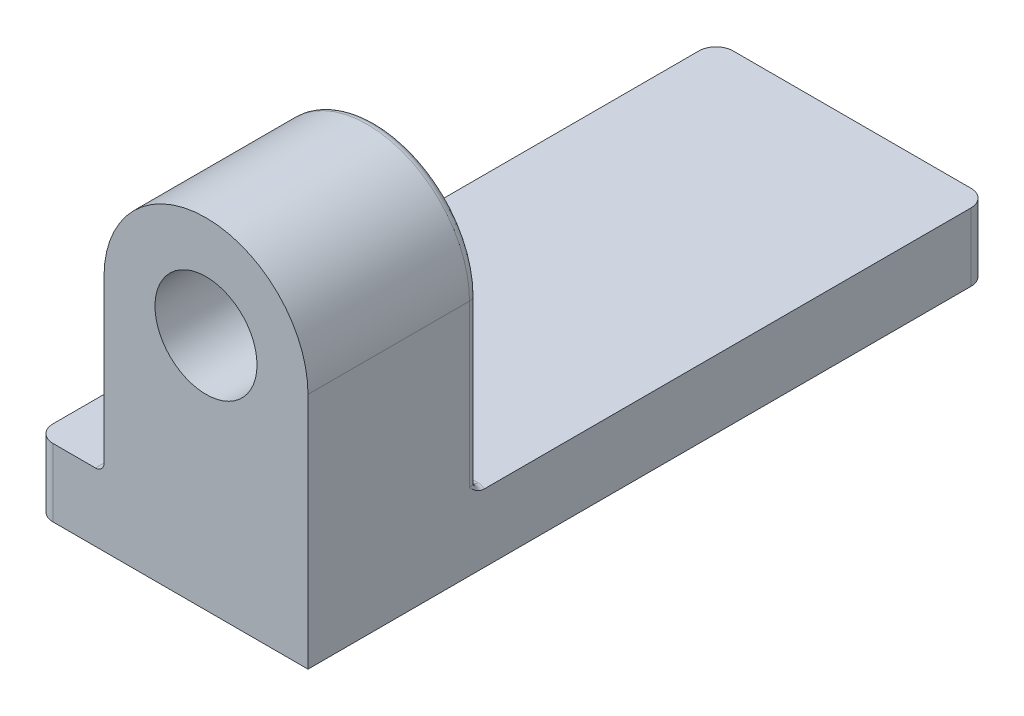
from build123d import *

# Parameters (mm, degrees)
SKETCH1_W           = 50.8
SKETCH1_H           = 12.7
BASE_EXTRUDE_DEPTH  = 127
BOSS_EXTRUDE1_DEPTH = 31.75
SKETCH3_R           = 9.525
CUT_EXTRUDE1_DEPTH  = 151.804144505
FILLET1_R           = 3.175
FILLET2_R           = 1.5875
FILLET3_R           = 1.5875


with BuildPart() as part:
    # Sketch1 → Base-Extrude (new body)
    with BuildSketch(Plane.XY):
        with Locations((25.4, 6.35)):
            Rectangle(SKETCH1_W, SKETCH1_H)
    extrude(amount=BASE_EXTRUDE_DEPTH)

    # Sketch2 → Boss-Extrude1 (add)
    with BuildSketch(Plane.XY.offset(127)):
        with BuildLine():
            Line((12.7, 12.7), (12.7, 44.45))
            ThreePointArc((12.7, 44.45), (31.75, 63.5), (50.8, 44.45))
            Line((50.8, 44.45), (50.8, 12.7))
            Line((50.8, 12.7), (12.7, 12.7))
        make_face()
    extrude(amount=-BOSS_EXTRUDE1_DEPTH)

    # Sketch3 → Cut-Extrude1 (cut, through all)
    with BuildSketch(Plane.XY.offset(127)):
        with Locations((31.75, 44.45)):
            Circle(SKETCH3_R)
    extrude(amount=-CUT_EXTRUDE1_DEPTH, mode=Mode.SUBTRACT)

    # Fillet1
    fillet1_edges = [part.edges().sort_by_distance(p)[0] for p in [
        (0, 6.35, 127),
        (50.8, 6.35, 0),
        (0, 6.35, 0),
    ]]
    fillet(fillet1_edges, radius=FILLET1_R)

    # Fillet2
    fillet2_edges = [part.edges().sort_by_distance(p)[0] for p in [
        (12.7, 28.575, 95.25),
        (31.75, 63.5, 95.25),
        (50.8, 28.575, 95.25),
    ]]
    fillet(fillet2_edges, radius=FILLET2_R)

    # Fillet3
    fillet3_edges = [part.edges().sort_by_distance(p)[0] for p in [
        (31.75, 12.7, 95.25),
        (12.7, 12.7, 111.91875),
        (13.164967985, 12.7, 95.714967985),
        (50.335032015, 12.7, 95.714967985),
    ]]
    fillet(fillet3_edges, radius=FILLET3_R)


solid = part.part
